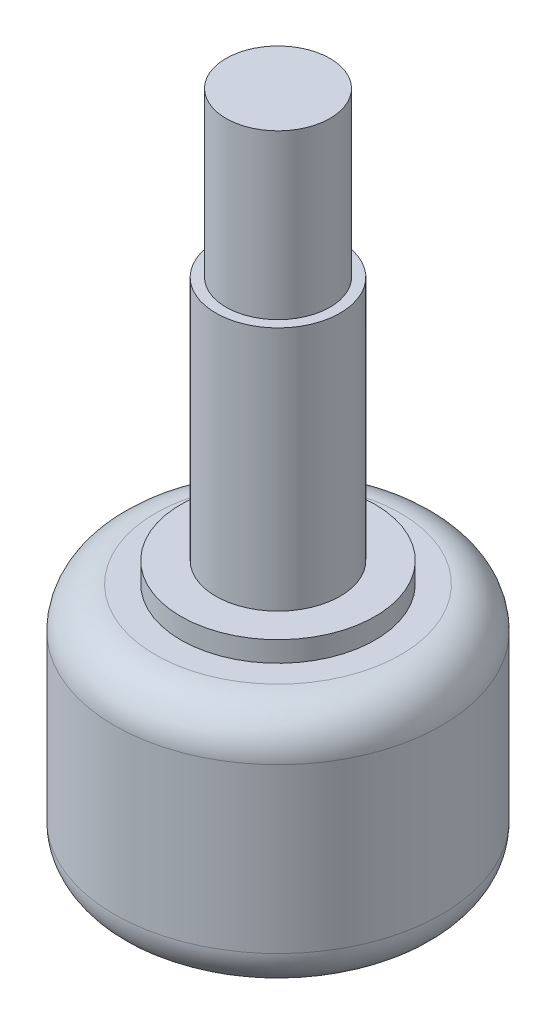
from build123d import *


with BuildPart() as part:
    # Sketch1 → Base-Revolve (revolve)
    with BuildSketch(Plane.XY, mode=Mode.PRIVATE) as base_revolve_sk:
        with BuildLine():
            Line((0, 0), (-4.7625, 0))
            ThreePointArc((-4.7625, 0), (-5.885032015, 0.464967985), (-6.35, 1.5875))
            Line((-6.35, 1.5875), (-6.35, 7.9375))
            ThreePointArc((-6.35, 7.9375), (-5.885032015, 9.060032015), (-4.7625, 9.525))
            Line((-4.7625, 9.525), (-3.7703125, 9.525))
            Line((-3.7703125, 9.525), (-3.7703125, 10.31875))
            Line((-3.7703125, 10.31875), (-2.413, 10.31875))
            Line((-2.413, 10.31875), (-2.413, 19.84375))
            Line((-2.413, 19.84375), (-2.0193, 19.84375))
            Line((-2.0193, 19.84375), (-2.0193, 26.19375))
            Line((-2.0193, 26.19375), (0, 26.19375))
            Line((0, 26.19375), (0, 0))
        make_face()
    revolve(base_revolve_sk.sketch.rotate(Axis((0, 0, 0), (0, 1, 0)), 270), axis=Axis((0, 0, 0), (0, 1, 0)))


solid = part.part
